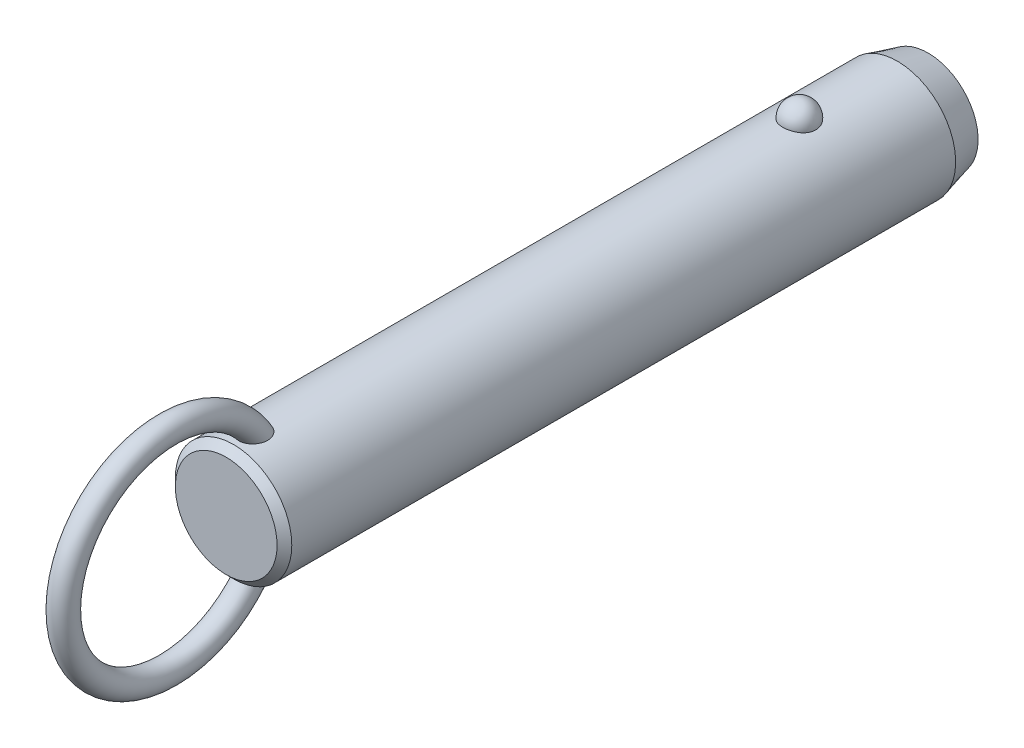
ISO-10303-21;
HEADER;
FILE_DESCRIPTION(('STEP AP214'),'2;1');
FILE_NAME('part.step','',(''),(''),'','','');
FILE_SCHEMA(('AUTOMOTIVE_DESIGN { 1 0 10303 214 1 1 1 1 }'));
ENDSEC;
DATA;
#1=APPLICATION_CONTEXT('core data for automotive mechanical design processes');
#2=APPLICATION_PROTOCOL_DEFINITION('international standard','automotive_design',2000,#1);
#3=PRODUCT_CONTEXT('',#1,'mechanical');
#4=PRODUCT('Part','Part','',(#3));
#5=PRODUCT_RELATED_PRODUCT_CATEGORY('part','',(#4));
#6=PRODUCT_DEFINITION_FORMATION('','',#4);
#7=PRODUCT_DEFINITION_CONTEXT('part definition',#1,'design');
#8=PRODUCT_DEFINITION('design','',#6,#7);
#9=PRODUCT_DEFINITION_SHAPE('','',#8);
#10=(LENGTH_UNIT() NAMED_UNIT(*) SI_UNIT(.MILLI.,.METRE.));
#11=(NAMED_UNIT(*) PLANE_ANGLE_UNIT() SI_UNIT($,.RADIAN.));
#12=(NAMED_UNIT(*) SI_UNIT($,.STERADIAN.) SOLID_ANGLE_UNIT());
#13=UNCERTAINTY_MEASURE_WITH_UNIT(LENGTH_MEASURE(1.E-05),#10,'distance_accuracy_value','');
#14=(GEOMETRIC_REPRESENTATION_CONTEXT(3) GLOBAL_UNCERTAINTY_ASSIGNED_CONTEXT((#13)) GLOBAL_UNIT_ASSIGNED_CONTEXT((#10,
#11,#12)) REPRESENTATION_CONTEXT('',''));
#15=CARTESIAN_POINT('',(0.,0.,0.));
#16=DIRECTION('',(0.,0.,1.));
#17=DIRECTION('',(1.,0.,0.));
#18=AXIS2_PLACEMENT_3D('',#15,#16,#17);
#19=CARTESIAN_POINT('',(0.,0.,81.3));
#20=DIRECTION('',(0.,0.,-1.));
#21=DIRECTION('',(-1.,0.,0.));
#22=AXIS2_PLACEMENT_3D('',#19,#20,#21);
#23=CYLINDRICAL_SURFACE('',#22,9.5);
#24=CARTESIAN_POINT('',(2.67259918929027,9.11631578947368,-2.70000000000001));
#25=CARTESIAN_POINT('',(2.6725968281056,9.11631786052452,-2.54909854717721));
#26=CARTESIAN_POINT('',(2.66030567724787,9.11994722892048,-2.39816735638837));
#27=CARTESIAN_POINT('',(2.6114347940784,9.13405924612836,-2.10058568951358));
#28=CARTESIAN_POINT('',(2.57484658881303,9.14454428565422,-1.95393672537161));
#29=CARTESIAN_POINT('',(2.47830875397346,9.17117631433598,-1.66916069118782));
#30=CARTESIAN_POINT('',(2.41836936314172,9.18732082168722,-1.53102991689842));
#31=CARTESIAN_POINT('',(2.27661331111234,9.22346780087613,-1.26705393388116));
#32=CARTESIAN_POINT('',(2.19479699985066,9.24347021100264,-1.14120852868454));
#33=CARTESIAN_POINT('',(2.01085282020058,9.28522401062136,-0.904632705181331));
#34=CARTESIAN_POINT('',(1.90862396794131,9.30698376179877,-0.793982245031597));
#35=CARTESIAN_POINT('',(1.6867437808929,9.34973971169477,-0.591607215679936));
#36=CARTESIAN_POINT('',(1.56709244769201,9.37073591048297,-0.499882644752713));
#37=CARTESIAN_POINT('',(1.31393976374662,9.40956370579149,-0.338167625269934));
#38=CARTESIAN_POINT('',(1.18048026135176,9.42740444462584,-0.268113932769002));
#39=CARTESIAN_POINT('',(0.903154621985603,9.45799906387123,-0.151390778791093));
#40=CARTESIAN_POINT('',(0.759289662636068,9.47075351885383,-0.104718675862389));
#41=CARTESIAN_POINT('',(0.468074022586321,9.48956256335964,-0.0367633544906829));
#42=CARTESIAN_POINT('',(0.320836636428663,9.49573643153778,-0.0150275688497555));
#43=CARTESIAN_POINT('',(0.0246714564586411,9.50112183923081,0.00396199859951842));
#44=CARTESIAN_POINT('',(-0.124256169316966,9.50033406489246,0.00121819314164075));
#45=CARTESIAN_POINT('',(-0.417264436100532,9.4919475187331,-0.0284441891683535));
#46=CARTESIAN_POINT('',(-0.56138413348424,9.48444885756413,-0.0550074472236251));
#47=CARTESIAN_POINT('',(-0.842986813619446,9.46357853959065,-0.131064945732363));
#48=CARTESIAN_POINT('',(-0.980469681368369,9.450206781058,-0.180559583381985));
#49=CARTESIAN_POINT('',(-1.24585005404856,9.41890822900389,-0.301476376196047));
#50=CARTESIAN_POINT('',(-1.37368611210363,9.40095498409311,-0.373026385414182));
#51=CARTESIAN_POINT('',(-1.61552738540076,9.36242964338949,-0.536025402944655));
#52=CARTESIAN_POINT('',(-1.72953116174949,9.34185727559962,-0.627476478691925));
#53=CARTESIAN_POINT('',(-1.9429225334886,9.29984568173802,-0.829844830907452));
#54=CARTESIAN_POINT('',(-2.04198021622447,9.27839736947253,-0.94110821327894));
#55=CARTESIAN_POINT('',(-2.22026460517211,9.23735994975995,-1.17883414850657));
#56=CARTESIAN_POINT('',(-2.29948985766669,9.21777097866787,-1.30529781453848));
#57=CARTESIAN_POINT('',(-2.43697287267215,9.18238994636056,-1.57158566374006));
#58=CARTESIAN_POINT('',(-2.49497068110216,9.16664569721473,-1.71155057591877));
#59=CARTESIAN_POINT('',(-2.5872073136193,9.14104303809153,-1.99961197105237));
#60=CARTESIAN_POINT('',(-2.62144683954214,9.13118445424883,-2.14770821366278));
#61=CARTESIAN_POINT('',(-2.66521466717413,9.11850622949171,-2.44715424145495));
#62=CARTESIAN_POINT('',(-2.67484831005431,9.11565658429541,-2.59848735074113));
#63=CARTESIAN_POINT('',(-2.66946735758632,9.11723375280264,-2.90067317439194));
#64=CARTESIAN_POINT('',(-2.65445345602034,9.12166036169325,-3.05152590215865));
#65=CARTESIAN_POINT('',(-2.60029711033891,9.13724422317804,-3.34766110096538));
#66=CARTESIAN_POINT('',(-2.56127978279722,9.14836656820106,-3.49296833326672));
#67=CARTESIAN_POINT('',(-2.46018844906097,9.17606676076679,-3.77477535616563));
#68=CARTESIAN_POINT('',(-2.39811349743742,9.1926448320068,-3.9112747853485));
#69=CARTESIAN_POINT('',(-2.25202303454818,9.22952198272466,-4.17244273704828));
#70=CARTESIAN_POINT('',(-2.16788714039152,9.24984129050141,-4.29704106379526));
#71=CARTESIAN_POINT('',(-1.9799408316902,9.29188255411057,-4.53013066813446));
#72=CARTESIAN_POINT('',(-1.87612963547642,9.31360456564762,-4.63862130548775));
#73=CARTESIAN_POINT('',(-1.65105429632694,9.35612959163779,-4.8369029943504));
#74=CARTESIAN_POINT('',(-1.52972405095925,9.37692871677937,-4.92661991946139));
#75=CARTESIAN_POINT('',(-1.27318250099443,9.41518970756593,-5.08429106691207));
#76=CARTESIAN_POINT('',(-1.13797219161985,9.432651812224,-5.15224684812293));
#77=CARTESIAN_POINT('',(-0.859280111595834,9.46208255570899,-5.26371827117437));
#78=CARTESIAN_POINT('',(-0.715925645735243,9.47411833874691,-5.30753421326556));
#79=CARTESIAN_POINT('',(-0.423550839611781,9.4916822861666,-5.37076321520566));
#80=CARTESIAN_POINT('',(-0.2745312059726,9.49721125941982,-5.39017930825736));
#81=CARTESIAN_POINT('',(0.0218446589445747,9.50110860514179,-5.40390587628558));
#82=CARTESIAN_POINT('',(0.16917707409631,9.49961381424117,-5.39869609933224));
#83=CARTESIAN_POINT('',(0.460808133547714,9.48993906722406,-5.36441955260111));
#84=CARTESIAN_POINT('',(0.605106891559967,9.48175936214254,-5.33535367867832));
#85=CARTESIAN_POINT('',(0.886027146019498,9.4596376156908,-5.25435587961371));
#86=CARTESIAN_POINT('',(1.02267710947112,9.44571881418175,-5.20251612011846));
#87=CARTESIAN_POINT('',(1.28523827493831,9.41358993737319,-5.07741549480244));
#88=CARTESIAN_POINT('',(1.41114877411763,9.39537958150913,-5.00415322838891));
#89=CARTESIAN_POINT('',(1.65085227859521,9.3562644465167,-4.83684599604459));
#90=CARTESIAN_POINT('',(1.76442346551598,9.33532178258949,-4.74249218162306));
#91=CARTESIAN_POINT('',(1.97425672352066,9.29321198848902,-4.53620389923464));
#92=CARTESIAN_POINT('',(2.07051582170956,9.27204482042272,-4.42426641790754));
#93=CARTESIAN_POINT('',(2.24490086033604,9.23139221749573,-4.18363183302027));
#94=CARTESIAN_POINT('',(2.32267019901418,9.21194380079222,-4.05466990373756));
#95=CARTESIAN_POINT('',(2.45584092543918,9.1773419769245,-3.78517836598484));
#96=CARTESIAN_POINT('',(2.5112497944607,9.16218713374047,-3.64465264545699));
#97=CARTESIAN_POINT('',(2.59380876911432,9.13913522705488,-3.37104301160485));
#98=CARTESIAN_POINT('',(2.62330266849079,9.13064624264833,-3.23871053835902));
#99=CARTESIAN_POINT('',(2.66269870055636,9.11923566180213,-2.97092664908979));
#100=CARTESIAN_POINT('',(2.67260130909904,9.11631393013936,-2.83547530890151));
#101=CARTESIAN_POINT('',(2.67259918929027,9.11631578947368,-2.70000000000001));
#102=B_SPLINE_CURVE_WITH_KNOTS('',3,(#24,#25,#26,#27,#28,#29,#30,#31,#32,#33,#34,#35,#36,#37,
#38,#39,#40,#41,#42,#43,#44,#45,#46,#47,#48,#49,#50,#51,#52,#53,#54,#55,#56,#57,#58,#59,#60,#61,
#62,#63,#64,#65,#66,#67,#68,#69,#70,#71,#72,#73,#74,#75,#76,#77,#78,#79,#80,#81,#82,#83,#84,#85,
#86,#87,#88,#89,#90,#91,#92,#93,#94,#95,#96,#97,#98,#99,#100,#101),.UNSPECIFIED.,.T.,.F.,(4,2,2,
2,2,2,2,2,2,2,2,2,2,2,2,2,2,2,2,2,2,2,2,2,2,2,2,2,2,2,2,2,2,2,2,2,2,2,4),(0.,0.452217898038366,
0.904593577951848,1.35677112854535,1.80894144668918,2.26340676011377,2.71787203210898,
3.17099820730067,3.62407318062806,4.0687883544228,4.51345969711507,4.95160616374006,
5.38976021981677,5.83050358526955,6.27129275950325,6.72071308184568,7.17016633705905,
7.62495278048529,8.07972578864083,8.53254856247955,8.98535859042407,9.43582813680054,
9.88631615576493,10.3393155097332,10.7923328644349,11.2471065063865,11.7018475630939,
12.150795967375,12.599688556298,13.0398725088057,13.4800399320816,13.9184421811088,
14.3568730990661,14.802202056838,15.2476074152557,15.7010097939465,16.1542603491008,
16.5602594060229,16.966248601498),.UNSPECIFIED.);
#103=CARTESIAN_POINT('',(2.67259918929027,9.11631578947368,-2.70000000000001));
#104=VERTEX_POINT('',#103);
#105=EDGE_CURVE('E41',#104,#104,#102,.T.);
#106=ORIENTED_EDGE('',*,*,#105,.T.);
#107=EDGE_LOOP('',(#106));
#108=FACE_BOUND('',#107,.T.);
#109=CARTESIAN_POINT('',(0.,0.,89.62));
#110=DIRECTION('',(0.,0.,1.));
#111=DIRECTION('',(1.,0.,0.));
#112=AXIS2_PLACEMENT_3D('',#109,#110,#111);
#113=CIRCLE('',#112,9.5);
#114=CARTESIAN_POINT('',(9.5,0.,89.62));
#115=VERTEX_POINT('',#114);
#116=EDGE_CURVE('E10',#115,#115,#113,.F.);
#117=ORIENTED_EDGE('',*,*,#116,.T.);
#118=EDGE_LOOP('',(#117));
#119=FACE_BOUND('',#118,.T.);
#120=CARTESIAN_POINT('',(-0.697062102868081,-9.47439269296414,83.9678088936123));
#121=CARTESIAN_POINT('',(-0.799579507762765,-9.46685146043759,84.0074823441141));
#122=CARTESIAN_POINT('',(-0.898575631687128,-9.45788043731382,84.0559309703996));
#123=CARTESIAN_POINT('',(-1.08670047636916,-9.43811593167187,84.1688685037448));
#124=CARTESIAN_POINT('',(-1.17583204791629,-9.42732297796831,84.2333527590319));
#125=CARTESIAN_POINT('',(-1.34179806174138,-9.40513672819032,84.3762099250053));
#126=CARTESIAN_POINT('',(-1.41865133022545,-9.39374438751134,84.454561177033));
#127=CARTESIAN_POINT('',(-1.5586004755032,-9.37154196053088,84.6227524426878));
#128=CARTESIAN_POINT('',(-1.62169476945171,-9.3607319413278,84.7125937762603));
#129=CARTESIAN_POINT('',(-1.73527695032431,-9.34035749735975,84.9045001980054));
#130=CARTESIAN_POINT('',(-1.7852226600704,-9.33085270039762,85.0068910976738));
#131=CARTESIAN_POINT('',(-1.86924997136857,-9.3143834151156,85.218148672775));
#132=CARTESIAN_POINT('',(-1.90332570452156,-9.30741986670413,85.3270177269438));
#133=CARTESIAN_POINT('',(-1.95893603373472,-9.29588482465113,85.5604730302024));
#134=CARTESIAN_POINT('',(-1.97872420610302,-9.29165182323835,85.6854890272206));
#135=CARTESIAN_POINT('',(-2.00062129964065,-9.28695978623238,85.9370805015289));
#136=CARTESIAN_POINT('',(-2.00272284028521,-9.28650232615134,86.063656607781));
#137=CARTESIAN_POINT('',(-1.98958876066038,-9.28932750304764,86.3368157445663));
#138=CARTESIAN_POINT('',(-1.97143366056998,-9.2932400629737,86.4832519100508));
#139=CARTESIAN_POINT('',(-1.91479925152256,-9.30507151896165,86.7720629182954));
#140=CARTESIAN_POINT('',(-1.87629122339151,-9.31299607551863,86.914431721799));
#141=CARTESIAN_POINT('',(-1.77225683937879,-9.33340232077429,87.2151725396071));
#142=CARTESIAN_POINT('',(-1.70334898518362,-9.34641636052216,87.3723691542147));
#143=CARTESIAN_POINT('',(-1.58111062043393,-9.36759153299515,87.5975171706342));
#144=CARTESIAN_POINT('',(-1.53721459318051,-9.37492619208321,87.6707968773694));
#145=CARTESIAN_POINT('',(-1.44302631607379,-9.38988566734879,87.8130740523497));
#146=CARTESIAN_POINT('',(-1.39273721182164,-9.39751033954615,87.8820736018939));
#147=CARTESIAN_POINT('',(-1.26775962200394,-9.41530678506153,88.0369832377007));
#148=CARTESIAN_POINT('',(-1.19052326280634,-9.42548108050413,88.1208712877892));
#149=CARTESIAN_POINT('',(-1.0242024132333,-9.44499825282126,88.2760086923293));
#150=CARTESIAN_POINT('',(-0.935139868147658,-9.45434261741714,88.3472808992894));
#151=CARTESIAN_POINT('',(-0.766610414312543,-9.46930670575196,88.4586955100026));
#152=CARTESIAN_POINT('',(-0.689439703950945,-9.47529223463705,88.5022354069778));
#153=CARTESIAN_POINT('',(-0.528942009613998,-9.48560294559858,88.5763133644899));
#154=CARTESIAN_POINT('',(-0.445620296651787,-9.48992953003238,88.6068624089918));
#155=CARTESIAN_POINT('',(-0.273901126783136,-9.49644161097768,88.6525792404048));
#156=CARTESIAN_POINT('',(-0.185465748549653,-9.49860811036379,88.66761059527));
#157=CARTESIAN_POINT('',(-0.00734541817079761,-9.5004135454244,88.6801494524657));
#158=CARTESIAN_POINT('',(0.0823387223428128,-9.50005405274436,88.6776678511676));
#159=CARTESIAN_POINT('',(0.247679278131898,-9.49708301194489,88.6569959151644));
#160=CARTESIAN_POINT('',(0.323620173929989,-9.49477609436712,88.6409300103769));
#161=CARTESIAN_POINT('',(0.471981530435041,-9.48855917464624,88.5971726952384));
#162=CARTESIAN_POINT('',(0.544400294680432,-9.48464840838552,88.569475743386));
#163=CARTESIAN_POINT('',(0.708947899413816,-9.47398336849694,88.4928026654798));
#164=CARTESIAN_POINT('',(0.799149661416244,-9.46671310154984,88.4397745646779));
#165=CARTESIAN_POINT('',(0.969783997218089,-9.45076225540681,88.3199731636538));
#166=CARTESIAN_POINT('',(1.05019415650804,-9.44207854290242,88.2531692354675));
#167=CARTESIAN_POINT('',(1.23092343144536,-9.42051459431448,88.0807596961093));
#168=CARTESIAN_POINT('',(1.32652499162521,-9.40733378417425,87.9702619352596));
#169=CARTESIAN_POINT('',(1.49893121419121,-9.38140745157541,87.7355614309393));
#170=CARTESIAN_POINT('',(1.57571616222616,-9.36866239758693,87.6113445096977));
#171=CARTESIAN_POINT('',(1.71285426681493,-9.34457644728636,87.3493891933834));
#172=CARTESIAN_POINT('',(1.77266365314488,-9.33328726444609,87.2113623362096));
#173=CARTESIAN_POINT('',(1.87239208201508,-9.31379209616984,86.9280515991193));
#174=CARTESIAN_POINT('',(1.91230158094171,-9.3055875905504,86.782764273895));
#175=CARTESIAN_POINT('',(1.9760418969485,-9.29228394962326,86.4620281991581));
#176=CARTESIAN_POINT('',(1.99587438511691,-9.28797202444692,86.2857248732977));
#177=CARTESIAN_POINT('',(2.0029570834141,-9.28645519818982,85.9324146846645));
#178=CARTESIAN_POINT('',(1.99025930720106,-9.28923895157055,85.7554093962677));
#179=CARTESIAN_POINT('',(1.93735479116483,-9.30038134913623,85.4563381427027));
#180=CARTESIAN_POINT('',(1.90576827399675,-9.30697680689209,85.3326679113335));
#181=CARTESIAN_POINT('',(1.82287484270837,-9.32356855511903,85.092329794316));
#182=CARTESIAN_POINT('',(1.77158213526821,-9.33356239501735,84.9756569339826));
#183=CARTESIAN_POINT('',(1.6488574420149,-9.35602275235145,84.7527061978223));
#184=CARTESIAN_POINT('',(1.57730995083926,-9.36850332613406,84.6464927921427));
#185=CARTESIAN_POINT('',(1.41543264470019,-9.39431873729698,84.4495530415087));
#186=CARTESIAN_POINT('',(1.32510883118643,-9.40765330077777,84.3588217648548));
#187=CARTESIAN_POINT('',(1.13846223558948,-9.43195720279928,84.2050334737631));
#188=CARTESIAN_POINT('',(1.0436989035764,-9.44302894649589,84.1400947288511));
#189=CARTESIAN_POINT('',(0.843965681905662,-9.46296805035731,84.0280388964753));
#190=CARTESIAN_POINT('',(0.739000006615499,-9.47183631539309,83.9809144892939));
#191=CARTESIAN_POINT('',(0.528175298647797,-9.48586140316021,83.9081173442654));
#192=CARTESIAN_POINT('',(0.422686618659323,-9.49119633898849,83.8814024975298));
#193=CARTESIAN_POINT('',(0.208590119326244,-9.49831365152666,83.8460137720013));
#194=CARTESIAN_POINT('',(0.0999817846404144,-9.500095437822,83.8373428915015));
#195=CARTESIAN_POINT('',(-0.126104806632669,-9.49988861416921,83.8383501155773));
#196=CARTESIAN_POINT('',(-0.243578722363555,-9.49757821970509,83.8495942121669));
#197=CARTESIAN_POINT('',(-0.474390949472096,-9.48885165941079,83.893167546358));
#198=CARTESIAN_POINT('',(-0.587729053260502,-9.48243528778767,83.9254978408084));
#199=CARTESIAN_POINT('',(-0.697062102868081,-9.47439269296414,83.9678088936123));
#200=B_SPLINE_CURVE_WITH_KNOTS('',3,(#120,#121,#122,#123,#124,#125,#126,#127,#128,#129,#130,
#131,#132,#133,#134,#135,#136,#137,#138,#139,#140,#141,#142,#143,#144,#145,#146,#147,#148,#149,
#150,#151,#152,#153,#154,#155,#156,#157,#158,#159,#160,#161,#162,#163,#164,#165,#166,#167,#168,
#169,#170,#171,#172,#173,#174,#175,#176,#177,#178,#179,#180,#181,#182,#183,#184,#185,#186,#187,
#188,#189,#190,#191,#192,#193,#194,#195,#196,#197,#198,#199),.UNSPECIFIED.,.T.,.F.,(4,2,2,2,2,2,
2,2,2,2,2,2,2,2,2,2,2,2,2,2,2,2,2,2,2,2,2,2,2,2,2,2,2,2,2,2,2,2,2,4),(0.,0.330119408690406,
0.660143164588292,0.989655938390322,1.31920659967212,1.66074728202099,2.00241415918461,
2.38088696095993,2.75951768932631,3.20065679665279,3.6424200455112,4.15620996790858,
4.41314162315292,4.66994734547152,5.0122866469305,5.35399933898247,5.61943037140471,
5.88463652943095,6.15215502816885,6.41950709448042,6.65144391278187,6.88349136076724,
7.19641200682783,7.51003602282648,7.9477971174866,8.38601491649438,8.83699707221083,
9.28819530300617,9.8177866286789,10.3465317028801,10.7284172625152,11.110028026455,
11.4938603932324,11.8775702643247,12.2220189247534,12.5663259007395,12.8915939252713,
13.2169159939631,13.5689650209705,13.9210316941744),.UNSPECIFIED.);
#201=CARTESIAN_POINT('',(-0.697062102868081,-9.47439269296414,83.9678088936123));
#202=VERTEX_POINT('',#201);
#203=EDGE_CURVE('E59',#202,#202,#200,.T.);
#204=ORIENTED_EDGE('',*,*,#203,.T.);
#205=EDGE_LOOP('',(#204));
#206=FACE_BOUND('',#205,.T.);
#207=CARTESIAN_POINT('',(-0.697062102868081,9.47439269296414,83.9678088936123));
#208=CARTESIAN_POINT('',(-0.597792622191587,9.48169483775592,83.9293956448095));
#209=CARTESIAN_POINT('',(-0.495106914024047,9.48766580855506,83.8991682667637));
#210=CARTESIAN_POINT('',(-0.285876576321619,9.49627648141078,83.8560327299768));
#211=CARTESIAN_POINT('',(-0.179324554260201,9.49890941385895,83.8431597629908));
#212=CARTESIAN_POINT('',(0.0344157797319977,9.50053798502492,83.8351666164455));
#213=CARTESIAN_POINT('',(0.141603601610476,9.49953613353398,83.8400341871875));
#214=CARTESIAN_POINT('',(0.353563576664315,9.49401038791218,83.8673654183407));
#215=CARTESIAN_POINT('',(0.45833679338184,9.48948807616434,83.88982117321));
#216=CARTESIAN_POINT('',(0.662493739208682,9.4774236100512,83.9516719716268));
#217=CARTESIAN_POINT('',(0.761881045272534,9.46988348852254,83.9910556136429));
#218=CARTESIAN_POINT('',(0.952608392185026,9.45260382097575,84.0856342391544));
#219=CARTESIAN_POINT('',(1.04394806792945,9.44286417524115,84.1408299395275));
#220=CARTESIAN_POINT('',(1.21712767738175,9.4221176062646,84.2660662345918));
#221=CARTESIAN_POINT('',(1.29885671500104,9.41109835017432,84.3362579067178));
#222=CARTESIAN_POINT('',(1.44978975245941,9.38903310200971,84.488980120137));
#223=CARTESIAN_POINT('',(1.51899278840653,9.37798710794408,84.5715116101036));
#224=CARTESIAN_POINT('',(1.64602857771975,9.35654375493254,84.7497763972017));
#225=CARTESIAN_POINT('',(1.70333052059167,9.34618688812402,84.8458916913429));
#226=CARTESIAN_POINT('',(1.80259341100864,9.32755128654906,85.045897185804));
#227=CARTESIAN_POINT('',(1.84454942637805,9.31927322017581,85.1497898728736));
#228=CARTESIAN_POINT('',(1.91637039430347,9.30478365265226,85.3722131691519));
#229=CARTESIAN_POINT('',(1.944805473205,9.29882552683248,85.4912192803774));
#230=CARTESIAN_POINT('',(1.98449865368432,9.29043398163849,85.7321436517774));
#231=CARTESIAN_POINT('',(1.99574908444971,9.28800213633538,85.8540631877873));
#232=CARTESIAN_POINT('',(2.00275141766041,9.28649645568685,86.1169324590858));
#233=CARTESIAN_POINT('',(1.99588238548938,9.28799035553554,86.2579529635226));
#234=CARTESIAN_POINT('',(1.96270559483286,9.29505517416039,86.5376217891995));
#235=CARTESIAN_POINT('',(1.93637872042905,9.30063010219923,86.676267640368));
#236=CARTESIAN_POINT('',(1.85949176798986,9.31633564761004,86.9725616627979));
#237=CARTESIAN_POINT('',(1.80549792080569,9.3270926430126,87.1292907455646));
#238=CARTESIAN_POINT('',(1.67376869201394,9.35163064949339,87.4322840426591));
#239=CARTESIAN_POINT('',(1.59603181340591,9.36541185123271,87.5785475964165));
#240=CARTESIAN_POINT('',(1.4360277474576,9.39110706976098,87.8258138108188));
#241=CARTESIAN_POINT('',(1.35831795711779,9.40278656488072,87.929791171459));
#242=CARTESIAN_POINT('',(1.18774483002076,9.42585025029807,88.1245347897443));
#243=CARTESIAN_POINT('',(1.09490932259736,9.43723493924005,88.2153247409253));
#244=CARTESIAN_POINT('',(0.921110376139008,9.45552616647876,88.3562033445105));
#245=CARTESIAN_POINT('',(0.843738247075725,9.46281058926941,88.4106563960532));
#246=CARTESIAN_POINT('',(0.681245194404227,9.47589120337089,88.5067117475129));
#247=CARTESIAN_POINT('',(0.596135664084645,9.48168953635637,88.5483325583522));
#248=CARTESIAN_POINT('',(0.433779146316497,9.49038144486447,88.6100899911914));
#249=CARTESIAN_POINT('',(0.357459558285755,9.49359170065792,88.6326013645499));
#250=CARTESIAN_POINT('',(0.202074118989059,9.49816761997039,88.6645745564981));
#251=CARTESIAN_POINT('',(0.123010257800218,9.49953459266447,88.6740456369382));
#252=CARTESIAN_POINT('',(-0.0357372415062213,9.50026497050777,88.6791143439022));
#253=CARTESIAN_POINT('',(-0.115421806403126,9.49962433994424,88.6746840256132));
#254=CARTESIAN_POINT('',(-0.272823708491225,9.49640854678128,88.6522962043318));
#255=CARTESIAN_POINT('',(-0.350540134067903,9.4938325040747,88.6343325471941));
#256=CARTESIAN_POINT('',(-0.500580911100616,9.4870946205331,88.5868028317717));
#257=CARTESIAN_POINT('',(-0.572979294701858,9.48296359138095,88.5574618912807));
#258=CARTESIAN_POINT('',(-0.712864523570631,9.47347609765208,88.4890087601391));
#259=CARTESIAN_POINT('',(-0.780349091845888,9.46811906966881,88.4498920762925));
#260=CARTESIAN_POINT('',(-0.94630921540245,9.45329720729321,88.3394327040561));
#261=CARTESIAN_POINT('',(-1.04090230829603,9.44321512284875,88.2623297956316));
#262=CARTESIAN_POINT('',(-1.21661929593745,9.42219227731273,88.0940971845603));
#263=CARTESIAN_POINT('',(-1.2977051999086,9.41124921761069,88.0029292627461));
#264=CARTESIAN_POINT('',(-1.47319646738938,9.38563439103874,87.7761621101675));
#265=CARTESIAN_POINT('',(-1.56208878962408,9.37102009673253,87.6362895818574));
#266=CARTESIAN_POINT('',(-1.71623987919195,9.34401559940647,87.3439503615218));
#267=CARTESIAN_POINT('',(-1.78147866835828,9.33162728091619,87.191473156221));
#268=CARTESIAN_POINT('',(-1.88853837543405,9.31055541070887,86.8756470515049));
#269=CARTESIAN_POINT('',(-1.92998995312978,9.30193076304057,86.7121685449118));
#270=CARTESIAN_POINT('',(-1.98590726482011,9.29015757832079,86.3805268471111));
#271=CARTESIAN_POINT('',(-2.0004070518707,9.2870021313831,86.2123698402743));
#272=CARTESIAN_POINT('',(-1.99964701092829,9.28716218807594,85.9050806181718));
#273=CARTESIAN_POINT('',(-1.9890814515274,9.28945704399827,85.7659362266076));
#274=CARTESIAN_POINT('',(-1.94566294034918,9.29865169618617,85.4911539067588));
#275=CARTESIAN_POINT('',(-1.9128206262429,9.30554929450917,85.355514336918));
#276=CARTESIAN_POINT('',(-1.84582133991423,9.31898248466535,85.1578026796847));
#277=CARTESIAN_POINT('',(-1.82038084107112,9.32400364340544,85.092583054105));
#278=CARTESIAN_POINT('',(-1.76350511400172,9.33492884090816,84.9649033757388));
#279=CARTESIAN_POINT('',(-1.73207305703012,9.34083241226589,84.9024418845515));
#280=CARTESIAN_POINT('',(-1.66324243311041,9.35333332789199,84.7809407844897));
#281=CARTESIAN_POINT('',(-1.62584239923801,9.35993084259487,84.721902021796));
#282=CARTESIAN_POINT('',(-1.54527678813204,9.37356864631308,84.6079875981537));
#283=CARTESIAN_POINT('',(-1.50211241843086,9.38060884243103,84.5531110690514));
#284=CARTESIAN_POINT('',(-1.3768114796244,9.40004442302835,84.409961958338));
#285=CARTESIAN_POINT('',(-1.28916358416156,9.41261047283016,84.3264295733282));
#286=CARTESIAN_POINT('',(-1.09996826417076,9.43658180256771,84.1772360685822));
#287=CARTESIAN_POINT('',(-0.998461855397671,9.44799034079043,84.1115238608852));
#288=CARTESIAN_POINT('',(-0.860188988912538,9.46103017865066,84.0394367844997));
#289=CARTESIAN_POINT('',(-0.828141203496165,9.46389141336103,84.0238511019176));
#290=CARTESIAN_POINT('',(-0.763210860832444,9.46934915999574,83.9944734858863));
#291=CARTESIAN_POINT('',(-0.73032830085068,9.47194567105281,83.9806815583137));
#292=CARTESIAN_POINT('',(-0.697062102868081,9.47439269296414,83.9678088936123));
#293=B_SPLINE_CURVE_WITH_KNOTS('',3,(#207,#208,#209,#210,#211,#212,#213,#214,#215,#216,#217,
#218,#219,#220,#221,#222,#223,#224,#225,#226,#227,#228,#229,#230,#231,#232,#233,#234,#235,#236,
#237,#238,#239,#240,#241,#242,#243,#244,#245,#246,#247,#248,#249,#250,#251,#252,#253,#254,#255,
#256,#257,#258,#259,#260,#261,#262,#263,#264,#265,#266,#267,#268,#269,#270,#271,#272,#273,#274,
#275,#276,#277,#278,#279,#280,#281,#282,#283,#284,#285,#286,#287,#288,#289,#290,#291,#292),
.UNSPECIFIED.,.T.,.F.,(4,2,2,2,2,2,2,2,2,2,2,2,2,2,2,2,2,2,2,2,2,2,2,2,2,2,2,2,2,2,2,2,2,2,2,2,
2,2,2,2,2,2,4),(0.,0.319942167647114,0.640532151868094,0.960900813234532,1.28112555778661,
1.60113495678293,1.92115886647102,2.24457323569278,2.56801248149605,2.90371927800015,
3.23953387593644,3.60560313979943,3.97183576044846,4.393836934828,4.81625324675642,
5.31257045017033,5.80891895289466,6.19868344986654,6.58773876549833,6.87145417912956,
7.15475838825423,7.3926375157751,7.63034760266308,7.86853584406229,8.10683246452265,
8.3406366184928,8.57454843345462,8.93983939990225,9.30614105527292,9.80266668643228,
10.2996107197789,10.8040753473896,11.3079021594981,11.7249776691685,12.1418541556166,
12.3521485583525,12.5623319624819,12.7725671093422,12.9827582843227,13.345827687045,
13.7078449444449,13.8150604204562,13.9222762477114),.UNSPECIFIED.);
#294=CARTESIAN_POINT('',(-0.697062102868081,9.47439269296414,83.9678088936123));
#295=VERTEX_POINT('',#294);
#296=EDGE_CURVE('E66',#295,#295,#293,.T.);
#297=ORIENTED_EDGE('',*,*,#296,.T.);
#298=EDGE_LOOP('',(#297));
#299=FACE_BOUND('',#298,.T.);
#300=CARTESIAN_POINT('',(0.,0.,-18.6999999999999));
#301=DIRECTION('',(0.,0.,-1.));
#302=DIRECTION('',(-1.,0.,0.));
#303=AXIS2_PLACEMENT_3D('',#300,#301,#302);
#304=CIRCLE('',#303,9.5);
#305=CARTESIAN_POINT('',(-9.5,0.,-18.6999999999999));
#306=VERTEX_POINT('',#305);
#307=EDGE_CURVE('E56',#306,#306,#304,.F.);
#308=ORIENTED_EDGE('',*,*,#307,.T.);
#309=EDGE_LOOP('',(#308));
#310=FACE_BOUND('',#309,.T.);
#311=ADVANCED_FACE('F37',(#108,#119,#206,#299,#310),#23,.T.);
#312=CARTESIAN_POINT('',(0.,0.,-23.7));
#313=DIRECTION('',(0.,0.,-1.));
#314=DIRECTION('',(-1.,0.,0.));
#315=AXIS2_PLACEMENT_3D('',#312,#313,#314);
#316=PLANE('',#315);
#317=CARTESIAN_POINT('',(0.,0.,-23.7));
#318=DIRECTION('',(0.,0.,-1.));
#319=DIRECTION('',(-1.,0.,0.));
#320=AXIS2_PLACEMENT_3D('',#317,#318,#319);
#321=CIRCLE('',#320,8.16025403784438);
#322=CARTESIAN_POINT('',(-8.16025403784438,0.,-23.7));
#323=VERTEX_POINT('',#322);
#324=EDGE_CURVE('E65',#323,#323,#321,.T.);
#325=ORIENTED_EDGE('',*,*,#324,.T.);
#326=EDGE_LOOP('',(#325));
#327=FACE_BOUND('',#326,.T.);
#328=ADVANCED_FACE('F84',(#327),#316,.T.);
#329=CARTESIAN_POINT('',(0.,0.,-23.7));
#330=DIRECTION('',(0.,0.,1.));
#331=DIRECTION('',(1.,0.,0.));
#332=AXIS2_PLACEMENT_3D('',#329,#330,#331);
#333=CONICAL_SURFACE('',#332,8.16025403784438,0.261799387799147);
#334=ORIENTED_EDGE('',*,*,#307,.F.);
#335=EDGE_LOOP('',(#334));
#336=FACE_BOUND('',#335,.T.);
#337=ORIENTED_EDGE('',*,*,#324,.F.);
#338=EDGE_LOOP('',(#337));
#339=FACE_BOUND('',#338,.T.);
#340=ADVANCED_FACE('F82',(#336,#339),#333,.T.);
#341=CARTESIAN_POINT('',(0.,0.,90.82));
#342=DIRECTION('',(0.,0.,1.));
#343=DIRECTION('',(1.,0.,0.));
#344=AXIS2_PLACEMENT_3D('',#341,#342,#343);
#345=PLANE('',#344);
#346=CARTESIAN_POINT('',(0.,0.,90.82));
#347=DIRECTION('',(0.,0.,1.));
#348=DIRECTION('',(1.,0.,0.));
#349=AXIS2_PLACEMENT_3D('',#346,#347,#348);
#350=CIRCLE('',#349,8.3);
#351=CARTESIAN_POINT('',(8.3,0.,90.82));
#352=VERTEX_POINT('',#351);
#353=EDGE_CURVE('E50',#352,#352,#350,.T.);
#354=ORIENTED_EDGE('',*,*,#353,.T.);
#355=EDGE_LOOP('',(#354));
#356=FACE_BOUND('',#355,.T.);
#357=ADVANCED_FACE('F76',(#356),#345,.T.);
#358=CARTESIAN_POINT('',(0.,0.,100.35));
#359=DIRECTION('',(1.,0.,0.));
#360=DIRECTION('',(0.,0.,-1.));
#361=AXIS2_PLACEMENT_3D('',#358,#359,#360);
#362=TOROIDAL_SURFACE('',#361,17.05,2.);
#363=ORIENTED_EDGE('',*,*,#296,.F.);
#364=EDGE_LOOP('',(#363));
#365=FACE_BOUND('',#364,.T.);
#366=ORIENTED_EDGE('',*,*,#203,.F.);
#367=EDGE_LOOP('',(#366));
#368=FACE_BOUND('',#367,.T.);
#369=ADVANCED_FACE('F72',(#365,#368),#362,.T.);
#370=CARTESIAN_POINT('',(0.,0.,90.82));
#371=DIRECTION('',(0.,0.,-1.));
#372=DIRECTION('',(-1.,0.,0.));
#373=AXIS2_PLACEMENT_3D('',#370,#371,#372);
#374=CONICAL_SURFACE('',#373,8.3,0.78539816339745);
#375=ORIENTED_EDGE('',*,*,#116,.F.);
#376=EDGE_LOOP('',(#375));
#377=FACE_BOUND('',#376,.T.);
#378=ORIENTED_EDGE('',*,*,#353,.F.);
#379=EDGE_LOOP('',(#378));
#380=FACE_BOUND('',#379,.T.);
#381=ADVANCED_FACE('F39',(#377,#380),#374,.T.);
#382=CARTESIAN_POINT('',(0.,9.5,-2.70000000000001));
#383=DIRECTION('',(0.,1.,0.));
#384=DIRECTION('',(0.,0.,-1.));
#385=AXIS2_PLACEMENT_3D('',#382,#383,#384);
#386=SPHERICAL_SURFACE('',#385,2.7);
#387=ORIENTED_EDGE('',*,*,#105,.F.);
#388=EDGE_LOOP('',(#387));
#389=FACE_BOUND('',#388,.T.);
#390=ADVANCED_FACE('F78',(#389),#386,.T.);
#391=CLOSED_SHELL('',(#311,#328,#340,#357,#369,#381,#390));
#392=MANIFOLD_SOLID_BREP('B2',#391);
#393=ADVANCED_BREP_SHAPE_REPRESENTATION('',(#18,#392),#14);
#394=SHAPE_DEFINITION_REPRESENTATION(#9,#393);
ENDSEC;
END-ISO-10303-21;
